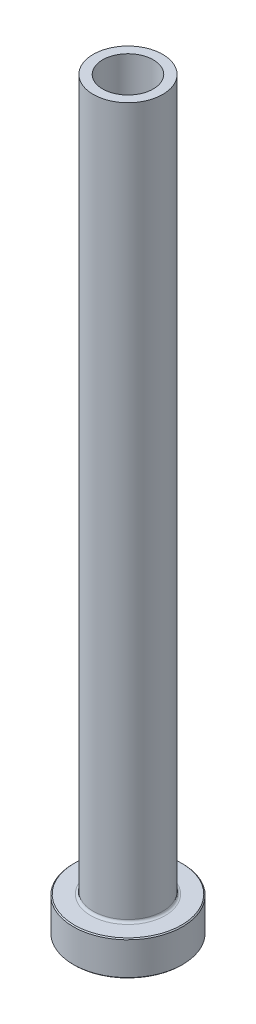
ISO-10303-21;
HEADER;
FILE_DESCRIPTION(('STEP AP214'),'2;1');
FILE_NAME('part.step','',(''),(''),'','','');
FILE_SCHEMA(('AUTOMOTIVE_DESIGN { 1 0 10303 214 1 1 1 1 }'));
ENDSEC;
DATA;
#1=APPLICATION_CONTEXT('core data for automotive mechanical design processes');
#2=APPLICATION_PROTOCOL_DEFINITION('international standard','automotive_design',2000,#1);
#3=PRODUCT_CONTEXT('',#1,'mechanical');
#4=PRODUCT('Part','Part','',(#3));
#5=PRODUCT_RELATED_PRODUCT_CATEGORY('part','',(#4));
#6=PRODUCT_DEFINITION_FORMATION('','',#4);
#7=PRODUCT_DEFINITION_CONTEXT('part definition',#1,'design');
#8=PRODUCT_DEFINITION('design','',#6,#7);
#9=PRODUCT_DEFINITION_SHAPE('','',#8);
#10=(LENGTH_UNIT() NAMED_UNIT(*) SI_UNIT(.MILLI.,.METRE.));
#11=(NAMED_UNIT(*) PLANE_ANGLE_UNIT() SI_UNIT($,.RADIAN.));
#12=(NAMED_UNIT(*) SI_UNIT($,.STERADIAN.) SOLID_ANGLE_UNIT());
#13=UNCERTAINTY_MEASURE_WITH_UNIT(LENGTH_MEASURE(1.E-05),#10,'distance_accuracy_value','');
#14=(GEOMETRIC_REPRESENTATION_CONTEXT(3) GLOBAL_UNCERTAINTY_ASSIGNED_CONTEXT((#13)) GLOBAL_UNIT_ASSIGNED_CONTEXT((#10,
#11,#12)) REPRESENTATION_CONTEXT('',''));
#15=CARTESIAN_POINT('',(0.,0.,0.));
#16=DIRECTION('',(0.,0.,1.));
#17=DIRECTION('',(1.,0.,0.));
#18=AXIS2_PLACEMENT_3D('',#15,#16,#17);
#19=CARTESIAN_POINT('',(0.,92.1876809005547,0.));
#20=DIRECTION('',(0.,1.,0.));
#21=DIRECTION('',(0.,0.,1.));
#22=AXIS2_PLACEMENT_3D('',#19,#20,#21);
#23=CYLINDRICAL_SURFACE('',#22,5.1);
#24=CARTESIAN_POINT('',(0.,150.,0.));
#25=DIRECTION('',(0.,1.,0.));
#26=DIRECTION('',(0.,0.,1.));
#27=AXIS2_PLACEMENT_3D('',#24,#25,#26);
#28=CIRCLE('',#27,5.1);
#29=CARTESIAN_POINT('',(0.,150.,5.1));
#30=VERTEX_POINT('',#29);
#31=EDGE_CURVE('E62',#30,#30,#28,.T.);
#32=ORIENTED_EDGE('',*,*,#31,.T.);
#33=EDGE_LOOP('',(#32));
#34=FACE_BOUND('',#33,.T.);
#35=CARTESIAN_POINT('',(0.,95.,0.));
#36=DIRECTION('',(0.,1.,0.));
#37=DIRECTION('',(0.,0.,1.));
#38=AXIS2_PLACEMENT_3D('',#35,#36,#37);
#39=CIRCLE('',#38,5.1);
#40=CARTESIAN_POINT('',(0.,95.,5.1));
#41=VERTEX_POINT('',#40);
#42=EDGE_CURVE('E71',#41,#41,#39,.T.);
#43=ORIENTED_EDGE('',*,*,#42,.F.);
#44=EDGE_LOOP('',(#43));
#45=FACE_BOUND('',#44,.T.);
#46=ADVANCED_FACE('F30',(#34,#45),#23,.F.);
#47=CARTESIAN_POINT('',(-5.1,150.,0.));
#48=DIRECTION('',(0.,1.,0.));
#49=DIRECTION('',(0.,0.,1.));
#50=AXIS2_PLACEMENT_3D('',#47,#48,#49);
#51=PLANE('',#50);
#52=CARTESIAN_POINT('',(0.,150.,0.));
#53=DIRECTION('',(0.,1.,0.));
#54=DIRECTION('',(0.,0.,1.));
#55=AXIS2_PLACEMENT_3D('',#52,#53,#54);
#56=CIRCLE('',#55,7.00000000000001);
#57=CARTESIAN_POINT('',(0.,150.,7.00000000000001));
#58=VERTEX_POINT('',#57);
#59=EDGE_CURVE('E65',#58,#58,#56,.T.);
#60=ORIENTED_EDGE('',*,*,#59,.T.);
#61=EDGE_LOOP('',(#60));
#62=FACE_BOUND('',#61,.T.);
#63=ORIENTED_EDGE('',*,*,#31,.F.);
#64=EDGE_LOOP('',(#63));
#65=FACE_BOUND('',#64,.T.);
#66=ADVANCED_FACE('F79',(#62,#65),#51,.T.);
#67=CARTESIAN_POINT('',(0.,92.1876809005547,0.));
#68=DIRECTION('',(0.,1.,0.));
#69=DIRECTION('',(0.,0.,1.));
#70=AXIS2_PLACEMENT_3D('',#67,#68,#69);
#71=CYLINDRICAL_SURFACE('',#70,7.);
#72=CARTESIAN_POINT('',(0.,7.50000000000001,0.));
#73=DIRECTION('',(0.,1.,0.));
#74=DIRECTION('',(0.,0.,1.));
#75=AXIS2_PLACEMENT_3D('',#72,#73,#74);
#76=CIRCLE('',#75,7.);
#77=CARTESIAN_POINT('',(0.,7.50000000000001,7.));
#78=VERTEX_POINT('',#77);
#79=EDGE_CURVE('E59',#78,#78,#76,.T.);
#80=ORIENTED_EDGE('',*,*,#79,.T.);
#81=EDGE_LOOP('',(#80));
#82=FACE_BOUND('',#81,.T.);
#83=ORIENTED_EDGE('',*,*,#59,.F.);
#84=EDGE_LOOP('',(#83));
#85=FACE_BOUND('',#84,.T.);
#86=ADVANCED_FACE('F85',(#82,#85),#71,.T.);
#87=CARTESIAN_POINT('',(-6.99999999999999,7.,0.));
#88=DIRECTION('',(0.,1.,0.));
#89=DIRECTION('',(0.,0.,1.));
#90=AXIS2_PLACEMENT_3D('',#87,#88,#89);
#91=PLANE('',#90);
#92=CARTESIAN_POINT('',(0.,7.,0.));
#93=DIRECTION('',(0.,1.,0.));
#94=DIRECTION('',(0.,0.,1.));
#95=AXIS2_PLACEMENT_3D('',#92,#93,#94);
#96=CIRCLE('',#95,10.8);
#97=CARTESIAN_POINT('',(0.,7.,10.8));
#98=VERTEX_POINT('',#97);
#99=EDGE_CURVE('E53',#98,#98,#96,.T.);
#100=ORIENTED_EDGE('',*,*,#99,.T.);
#101=EDGE_LOOP('',(#100));
#102=FACE_BOUND('',#101,.T.);
#103=CARTESIAN_POINT('',(0.,7.,0.));
#104=DIRECTION('',(0.,1.,0.));
#105=DIRECTION('',(0.,0.,1.));
#106=AXIS2_PLACEMENT_3D('',#103,#104,#105);
#107=CIRCLE('',#106,7.5);
#108=CARTESIAN_POINT('',(0.,7.,7.5));
#109=VERTEX_POINT('',#108);
#110=EDGE_CURVE('E56',#109,#109,#107,.F.);
#111=ORIENTED_EDGE('',*,*,#110,.T.);
#112=EDGE_LOOP('',(#111));
#113=FACE_BOUND('',#112,.T.);
#114=ADVANCED_FACE('F111',(#102,#113),#91,.T.);
#115=CARTESIAN_POINT('',(0.,92.1876809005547,0.));
#116=DIRECTION('',(0.,1.,0.));
#117=DIRECTION('',(0.,0.,1.));
#118=AXIS2_PLACEMENT_3D('',#115,#116,#117);
#119=CYLINDRICAL_SURFACE('',#118,11.);
#120=CARTESIAN_POINT('',(0.,6.79999999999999,0.));
#121=DIRECTION('',(0.,1.,0.));
#122=DIRECTION('',(0.,0.,1.));
#123=AXIS2_PLACEMENT_3D('',#120,#121,#122);
#124=CIRCLE('',#123,11.);
#125=CARTESIAN_POINT('',(0.,6.79999999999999,11.));
#126=VERTEX_POINT('',#125);
#127=EDGE_CURVE('E45',#126,#126,#124,.F.);
#128=ORIENTED_EDGE('',*,*,#127,.T.);
#129=EDGE_LOOP('',(#128));
#130=FACE_BOUND('',#129,.T.);
#131=CARTESIAN_POINT('',(0.,0.200000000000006,0.));
#132=DIRECTION('',(0.,-1.,0.));
#133=DIRECTION('',(0.,0.,-1.));
#134=AXIS2_PLACEMENT_3D('',#131,#132,#133);
#135=CIRCLE('',#134,11.);
#136=CARTESIAN_POINT('',(0.,0.200000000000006,-11.));
#137=VERTEX_POINT('',#136);
#138=EDGE_CURVE('E50',#137,#137,#135,.F.);
#139=ORIENTED_EDGE('',*,*,#138,.T.);
#140=EDGE_LOOP('',(#139));
#141=FACE_BOUND('',#140,.T.);
#142=ADVANCED_FACE('F108',(#130,#141),#119,.T.);
#143=CARTESIAN_POINT('',(-11.,0.,0.));
#144=DIRECTION('',(0.,-1.,0.));
#145=DIRECTION('',(0.,0.,-1.));
#146=AXIS2_PLACEMENT_3D('',#143,#144,#145);
#147=PLANE('',#146);
#148=CARTESIAN_POINT('',(0.,0.,0.));
#149=DIRECTION('',(0.,-1.,0.));
#150=DIRECTION('',(0.,0.,-1.));
#151=AXIS2_PLACEMENT_3D('',#148,#149,#150);
#152=CIRCLE('',#151,5.85000000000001);
#153=CARTESIAN_POINT('',(0.,0.,-5.85000000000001));
#154=VERTEX_POINT('',#153);
#155=EDGE_CURVE('E37',#154,#154,#152,.F.);
#156=ORIENTED_EDGE('',*,*,#155,.T.);
#157=EDGE_LOOP('',(#156));
#158=FACE_BOUND('',#157,.T.);
#159=CARTESIAN_POINT('',(0.,0.,0.));
#160=DIRECTION('',(0.,-1.,0.));
#161=DIRECTION('',(0.,0.,-1.));
#162=AXIS2_PLACEMENT_3D('',#159,#160,#161);
#163=CIRCLE('',#162,10.8);
#164=CARTESIAN_POINT('',(0.,0.,-10.8));
#165=VERTEX_POINT('',#164);
#166=EDGE_CURVE('E41',#165,#165,#163,.T.);
#167=ORIENTED_EDGE('',*,*,#166,.T.);
#168=EDGE_LOOP('',(#167));
#169=FACE_BOUND('',#168,.T.);
#170=ADVANCED_FACE('F110',(#158,#169),#147,.T.);
#171=CARTESIAN_POINT('',(0.,92.1876809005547,0.));
#172=DIRECTION('',(0.,1.,0.));
#173=DIRECTION('',(0.,0.,1.));
#174=AXIS2_PLACEMENT_3D('',#171,#172,#173);
#175=CYLINDRICAL_SURFACE('',#174,5.35);
#176=CARTESIAN_POINT('',(0.,0.500000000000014,0.));
#177=DIRECTION('',(0.,-1.,0.));
#178=DIRECTION('',(0.,0.,-1.));
#179=AXIS2_PLACEMENT_3D('',#176,#177,#178);
#180=CIRCLE('',#179,5.35);
#181=CARTESIAN_POINT('',(0.,0.500000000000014,-5.35));
#182=VERTEX_POINT('',#181);
#183=EDGE_CURVE('E10',#182,#182,#180,.T.);
#184=ORIENTED_EDGE('',*,*,#183,.T.);
#185=EDGE_LOOP('',(#184));
#186=FACE_BOUND('',#185,.T.);
#187=CARTESIAN_POINT('',(0.,83.,0.));
#188=DIRECTION('',(0.,1.,0.));
#189=DIRECTION('',(0.,0.,1.));
#190=AXIS2_PLACEMENT_3D('',#187,#188,#189);
#191=CIRCLE('',#190,5.35);
#192=CARTESIAN_POINT('',(0.,83.,5.35));
#193=VERTEX_POINT('',#192);
#194=EDGE_CURVE('E68',#193,#193,#191,.T.);
#195=ORIENTED_EDGE('',*,*,#194,.T.);
#196=EDGE_LOOP('',(#195));
#197=FACE_BOUND('',#196,.T.);
#198=ADVANCED_FACE('F118',(#186,#197),#175,.F.);
#199=CARTESIAN_POINT('',(0.,83.,0.));
#200=DIRECTION('',(0.,-1.,0.));
#201=DIRECTION('',(0.,0.,-1.));
#202=AXIS2_PLACEMENT_3D('',#199,#200,#201);
#203=CONICAL_SURFACE('',#202,5.35,0.0208303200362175);
#204=ORIENTED_EDGE('',*,*,#42,.T.);
#205=EDGE_LOOP('',(#204));
#206=FACE_BOUND('',#205,.T.);
#207=ORIENTED_EDGE('',*,*,#194,.F.);
#208=EDGE_LOOP('',(#207));
#209=FACE_BOUND('',#208,.T.);
#210=ADVANCED_FACE('F75',(#206,#209),#203,.F.);
#211=CARTESIAN_POINT('',(0.,7.50000000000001,0.));
#212=DIRECTION('',(0.,1.,0.));
#213=DIRECTION('',(0.,0.,1.));
#214=AXIS2_PLACEMENT_3D('',#211,#212,#213);
#215=TOROIDAL_SURFACE('',#214,7.5,0.5);
#216=ORIENTED_EDGE('',*,*,#110,.F.);
#217=EDGE_LOOP('',(#216));
#218=FACE_BOUND('',#217,.T.);
#219=ORIENTED_EDGE('',*,*,#79,.F.);
#220=EDGE_LOOP('',(#219));
#221=FACE_BOUND('',#220,.T.);
#222=ADVANCED_FACE('F90',(#218,#221),#215,.F.);
#223=CARTESIAN_POINT('',(0.,7.00000000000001,0.));
#224=DIRECTION('',(0.,-1.,0.));
#225=DIRECTION('',(0.,0.,-1.));
#226=AXIS2_PLACEMENT_3D('',#223,#224,#225);
#227=CONICAL_SURFACE('',#226,10.8,0.785398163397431);
#228=ORIENTED_EDGE('',*,*,#127,.F.);
#229=EDGE_LOOP('',(#228));
#230=FACE_BOUND('',#229,.T.);
#231=ORIENTED_EDGE('',*,*,#99,.F.);
#232=EDGE_LOOP('',(#231));
#233=FACE_BOUND('',#232,.T.);
#234=ADVANCED_FACE('F93',(#230,#233),#227,.T.);
#235=CARTESIAN_POINT('',(0.,0.200000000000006,0.));
#236=DIRECTION('',(0.,1.,0.));
#237=DIRECTION('',(0.,0.,1.));
#238=AXIS2_PLACEMENT_3D('',#235,#236,#237);
#239=CONICAL_SURFACE('',#238,11.,0.785398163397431);
#240=ORIENTED_EDGE('',*,*,#166,.F.);
#241=EDGE_LOOP('',(#240));
#242=FACE_BOUND('',#241,.T.);
#243=ORIENTED_EDGE('',*,*,#138,.F.);
#244=EDGE_LOOP('',(#243));
#245=FACE_BOUND('',#244,.T.);
#246=ADVANCED_FACE('F96',(#242,#245),#239,.T.);
#247=CARTESIAN_POINT('',(0.,0.,0.));
#248=DIRECTION('',(0.,-1.,0.));
#249=DIRECTION('',(0.,0.,-1.));
#250=AXIS2_PLACEMENT_3D('',#247,#248,#249);
#251=CONICAL_SURFACE('',#250,5.85000000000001,0.785398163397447);
#252=ORIENTED_EDGE('',*,*,#183,.F.);
#253=EDGE_LOOP('',(#252));
#254=FACE_BOUND('',#253,.T.);
#255=ORIENTED_EDGE('',*,*,#155,.F.);
#256=EDGE_LOOP('',(#255));
#257=FACE_BOUND('',#256,.T.);
#258=ADVANCED_FACE('F32',(#254,#257),#251,.F.);
#259=CLOSED_SHELL('',(#46,#66,#86,#114,#142,#170,#198,#210,#222,#234,#246,#258));
#260=MANIFOLD_SOLID_BREP('B2',#259);
#261=ADVANCED_BREP_SHAPE_REPRESENTATION('',(#18,#260),#14);
#262=SHAPE_DEFINITION_REPRESENTATION(#9,#261);
ENDSEC;
END-ISO-10303-21;
